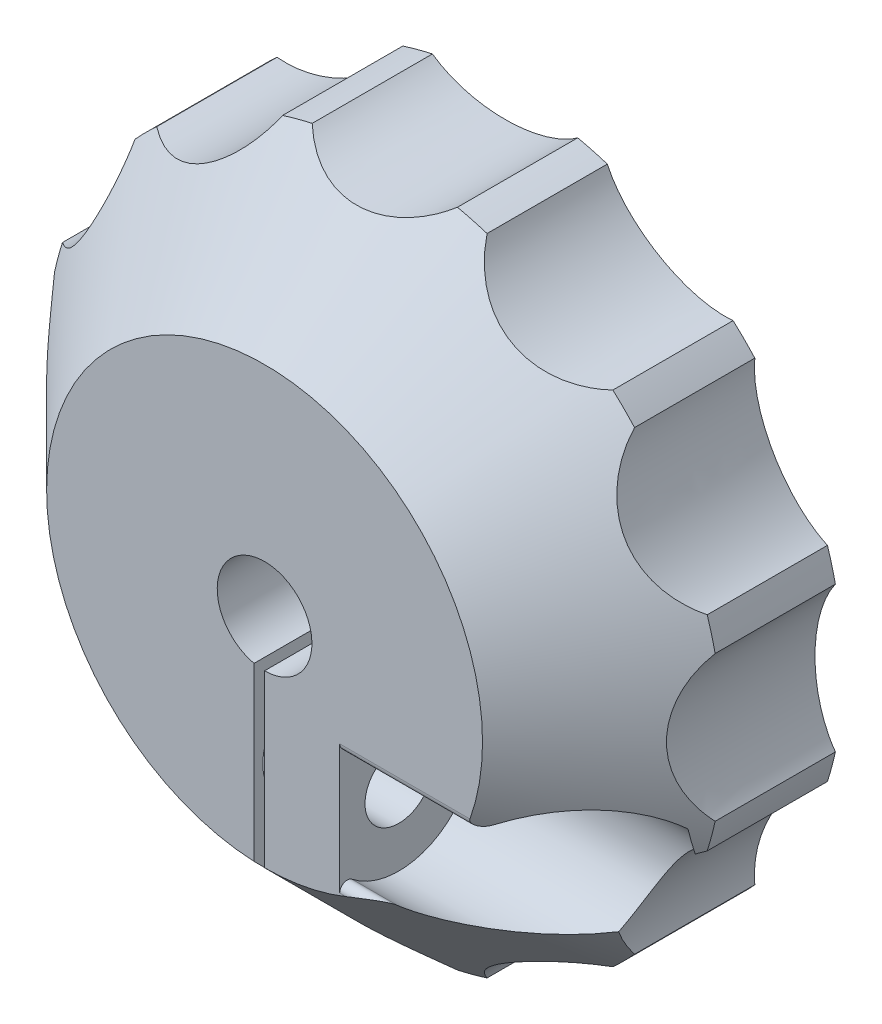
from build123d import *

# Parameters (mm, degrees)
ESQUISSE1_R                  = 22.5
ESQUISSE1_R_2                = 3.15
BOSS_EXTRU_1_DEPTH           = 16
CHANFREIN1_SIZE              = 8
ESQUISSE2_R                  = 12.886172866
ESQUISSE2_R_2                = 4.9
BOSS_EXTRU_2_DEPTH           = 16
ENL_V_MAT_EXTRU_1_DEPTH      = 36.616007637
ENL_V_MAT_EXTRU_1_DEPTH_BACK = 36.616007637
ESQUISSE3_R                  = 2.25
ESQUISSE4_W                  = 0.70151437
ESQUISSE4_H                  = 22.04810433
ENL_V_MAT_EXTRU_2_DEPTH      = 36.616007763
ESQUISSE5_RX                 = 6.280975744
ESQUISSE5_RY                 = 3.757932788
ENL_V_MAT_EXTRU_3_DEPTH      = 36.616007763
R_P_TITION_CIRCULAIRE1_COUNT = 12
ENL_V_START                  = 5
ESQUISSE6_R                  = 5
ENL_V_MAT_EXTRU_4_DEPTH      = 16
ESQUISSE7_R                  = 3.35
ENL_V_MAT_EXTRU_5_DEPTH      = 36.399419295
ENL_V_MAT_EXTRU_5_DRAFT      = 0.5
CONG_1_R                     = 0.5


with BuildPart() as part:
    # Esquisse1 → Boss.-Extru.1 (new body)
    with BuildSketch(Plane.XY):
        Circle(ESQUISSE1_R)
        Circle(ESQUISSE1_R_2, mode=Mode.SUBTRACT)
    extrude(amount=BOSS_EXTRU_1_DEPTH)

    # Chanfrein1
    chanfrein1_edges = [part.edges().sort_by_distance(p)[0] for p in [
        (-22.5, 0, 16),
    ]]
    chamfer(chanfrein1_edges, length=CHANFREIN1_SIZE)

    # Esquisse2 → Boss.-Extru.2 (add)
    with BuildSketch(Plane.XY.offset(16)):
        Circle(ESQUISSE2_R)
        Circle(ESQUISSE2_R_2, mode=Mode.SUBTRACT)
    extrude(amount=-BOSS_EXTRU_2_DEPTH)

    # Esquisse3 → Enl_v. mat.-Extru.1 (cut, two sides: drawn at the far end of the back side and taken through both)
    with BuildSketch(Plane(origin=(0, 0, 0), x_dir=(0, 0, -1), z_dir=(1, 0, 0)).offset(-ENL_V_MAT_EXTRU_1_DEPTH_BACK)):
        with Locations(Location((-12.068783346, -9.154762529, 0), (0, 0, 0.202574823))):
            Circle(ESQUISSE3_R)
    extrude(amount=ENL_V_MAT_EXTRU_1_DEPTH + ENL_V_MAT_EXTRU_1_DEPTH_BACK, mode=Mode.SUBTRACT)

    # Esquisse4 → Enl_v. mat.-Extru.2 (cut, through all)
    with BuildSketch(Plane.XY.offset(16)):
        with Locations((-0.350757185, -13.283420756)):
            Rectangle(ESQUISSE4_W, ESQUISSE4_H)
    extrude(amount=-ENL_V_MAT_EXTRU_2_DEPTH, mode=Mode.SUBTRACT)

    # Esquisse5 → Enl_v. mat.-Extru.3 (cut, through all)
    with BuildSketch(Plane.XY.offset(16)):
        with Locations((0, 24.375488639)):
            Ellipse(ESQUISSE5_RX, ESQUISSE5_RY)
    enl_v_mat_extru_3 = extrude(amount=-ENL_V_MAT_EXTRU_3_DEPTH, mode=Mode.SUBTRACT)

    # R_p_tition circulaire1: Enl_v. mat.-Extru.3 ×12 about axis
    r_p_tition_circulaire1_axis = Axis((0, 0, 16), (0, 0, -1))
    for i in range(1, R_P_TITION_CIRCULAIRE1_COUNT):
        add(enl_v_mat_extru_3.rotate(r_p_tition_circulaire1_axis, i * 360 / R_P_TITION_CIRCULAIRE1_COUNT), mode=Mode.SUBTRACT)

    # Esquisse6 → Enl_v. mat.-Extru.4 (cut)
    with BuildSketch(Plane(origin=(0, 0, 0), x_dir=(0, 0, -1), z_dir=(1, 0, 0)).offset(ENL_V_START)):
        with Locations((-12.068783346, -9.154762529)):
            Circle(ESQUISSE6_R)
    extrude(amount=ENL_V_MAT_EXTRU_4_DEPTH, mode=Mode.SUBTRACT)


with BuildPart() as enl_v_mat_extru_5_tool:
    # Esquisse7 → Enl_v. mat.-Extru.5 (with draft: the straight prism first)
    with BuildSketch(Plane(origin=(-0.70151437, 0, 0), x_dir=(0, 0, -1), z_dir=(1, 0, 0))):
        with Locations((-12.068783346, -9.154762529)):
            Circle(ESQUISSE7_R)
    extrude(amount=-ENL_V_MAT_EXTRU_5_DEPTH)
    # Enl_v. mat.-Extru.5: the draft: its side faces are tilted about the plane it starts from
    enl_v_mat_extru_5_sides = [enl_v_mat_extru_5_tool.faces().sort_by_distance(p)[0] for p in [
        (-18.901224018, -9.154762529, 15.418783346),
    ]]
    draft(enl_v_mat_extru_5_sides, Plane(origin=(-0.70151437, 0, 0), x_dir=(0, 0, -1), z_dir=(1, 0, 0)), ENL_V_MAT_EXTRU_5_DRAFT)


with BuildPart() as part_1:
    add(part.part)

    # Enl_v. mat.-Extru.5: cut by enl_v_mat_extru_5_tool
    add(enl_v_mat_extru_5_tool.part, mode=Mode.SUBTRACT)

    # Cong_1
    cong_1_edges = [part_1.edges().sort_by_distance(p)[0] for p in [
        (9.085279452, -6.065177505, 16),
        (6.383489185, -12.244347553, 16),
    ]]
    fillet(cong_1_edges, radius=CONG_1_R)


solid = part_1.part
